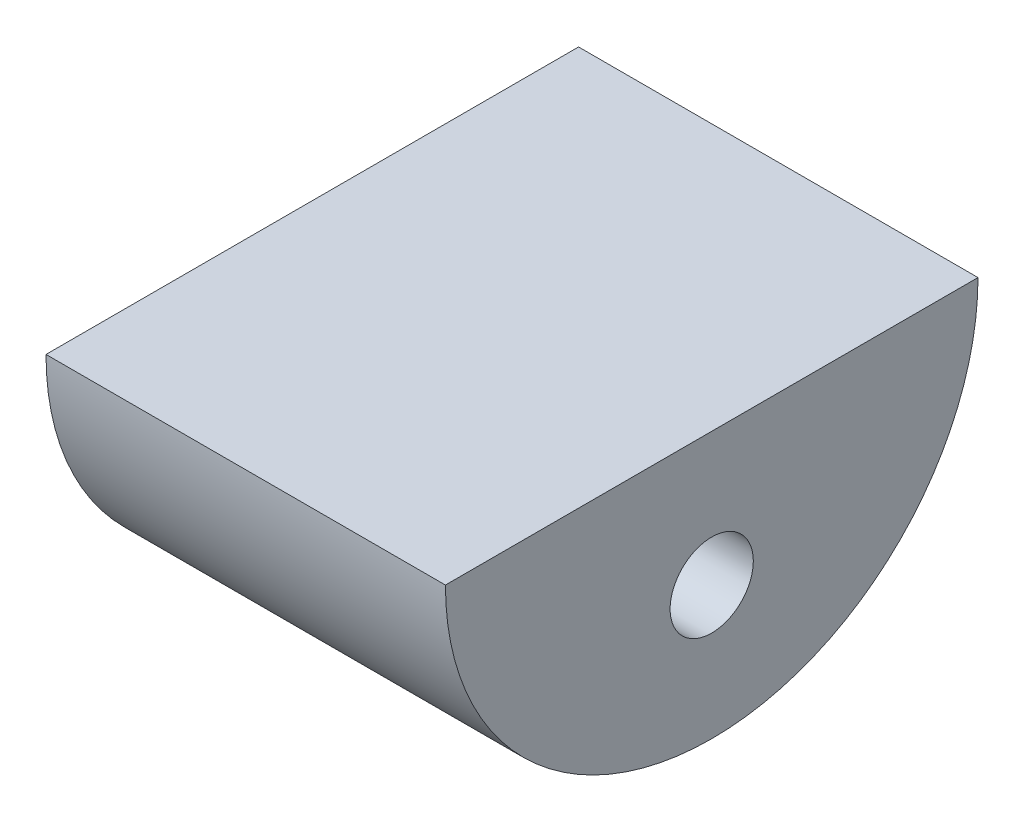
from build123d import *

# Parameters (mm, degrees)
BOSS_EXTRUDE1_DEPTH = 120
SKETCH2_R           = 12.5
CUT_EXTRUDE1_DEPTH  = 20


with BuildPart() as part:
    # Sketch1 → Boss-Extrude1 (new body)
    with BuildSketch(Plane(origin=(0, 0, 0), x_dir=(0, 0, -1), z_dir=(1, 0, 0))):
        with BuildLine():
            Line((80, 40), (-80, 40))
            ThreePointArc((-80, 40), (0, -40), (80, 40))
        make_face()
    extrude(amount=-BOSS_EXTRUDE1_DEPTH)

    # Sketch2 → Cut-Extrude1 (cut)
    with BuildSketch(Plane(origin=(0, 0, 0), x_dir=(0, 0, -1), z_dir=(1, 0, 0))):
        Circle(SKETCH2_R)
    extrude(amount=-CUT_EXTRUDE1_DEPTH, mode=Mode.SUBTRACT)


solid = part.part
